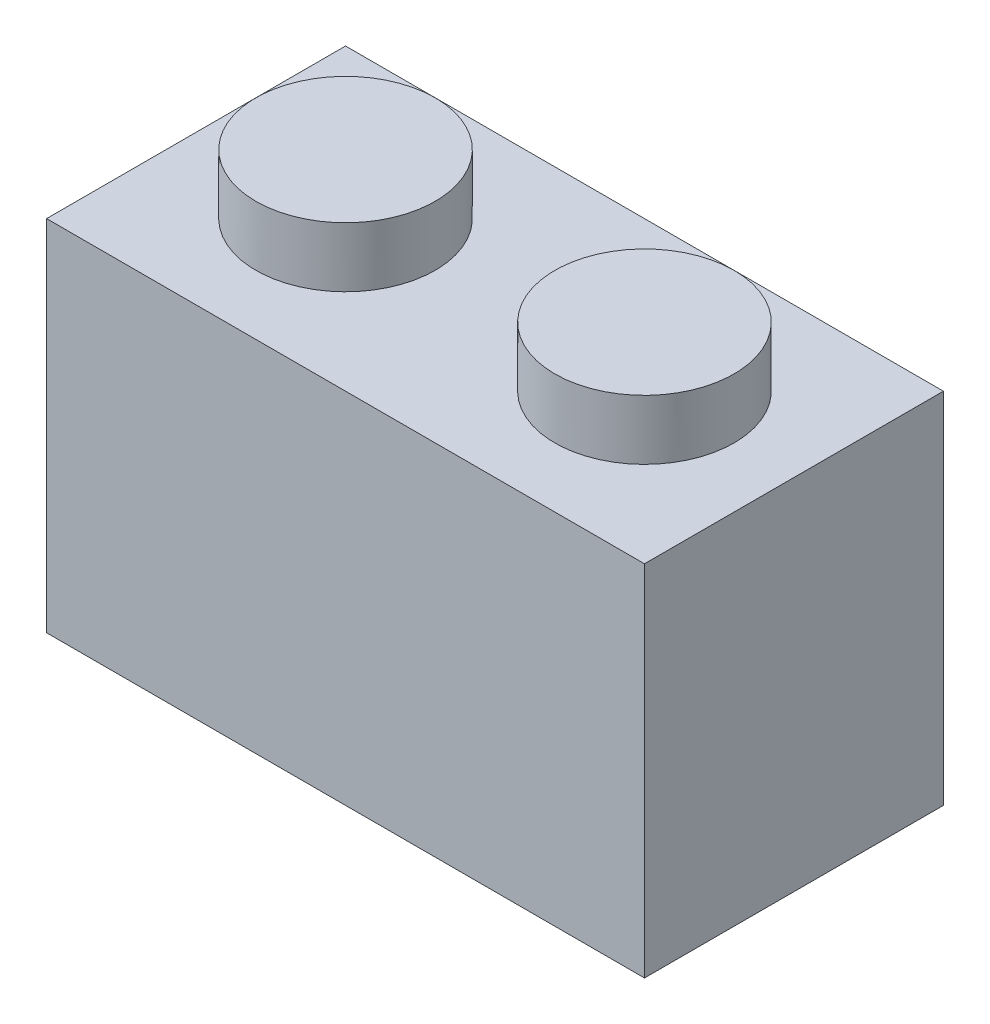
from build123d import *

# Parameters (mm, degrees)
SKETCH1_W           = 16
SKETCH1_H           = 8
BOSS_EXTRUDE1_DEPTH = 9.6
SKETCH2_R           = 2.4
BOSS_EXTRUDE2_DEPTH = 1.6
SHELL1_T            = -1.6
BOSS_EXTRUDE3_DEPTH = 8


with BuildPart() as part:
    # Sketch1 → Boss-Extrude1 (new body)
    with BuildSketch(Plane(origin=(0, 0, 0), x_dir=(1, 0, 0), z_dir=(0, 1, 0))):
        Rectangle(SKETCH1_W, SKETCH1_H)
    extrude(amount=BOSS_EXTRUDE1_DEPTH)

    # Sketch2 → Boss-Extrude2 (add)
    with BuildSketch(Plane(origin=(0, 9.6, 0), x_dir=(1, 0, 0), z_dir=(0, 1, 0))):
        with Locations(Location((-4, 0, 0), (0, 0, 90))):
            Circle(SKETCH2_R)
        with Locations(Location((4, 0, 0), (0, 0, 90))):
            Circle(SKETCH2_R)
    extrude(amount=BOSS_EXTRUDE2_DEPTH)

    # Shell1
    shell1_openings = [part.faces().sort_by_distance(p)[0] for p in [
        (0, 0, 0),
    ]]
    offset(amount=SHELL1_T, openings=shell1_openings, kind=Kind.INTERSECTION)

    # Sketch3 → Boss-Extrude3 (add)
    with BuildSketch(Plane.XZ):
        with BuildLine():
            Line((-0.4, 2.4), (-0.4, 1.549193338))
            ThreePointArc((-0.4, 1.549193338), (-1.6, 0), (-0.4, -1.549193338))
            Line((-0.4, -1.549193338), (-0.4, -2.4))
            Line((-0.4, -2.4), (0.4, -2.4))
            Line((0.4, -2.4), (0.4, -1.549193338))
            ThreePointArc((0.4, -1.549193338), (1.6, 0), (0.4, 1.549193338))
            Line((0.4, 1.549193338), (0.4, 2.4))
            Line((0.4, 2.4), (-0.4, 2.4))
        make_face()
    extrude(amount=-BOSS_EXTRUDE3_DEPTH)


solid = part.part
